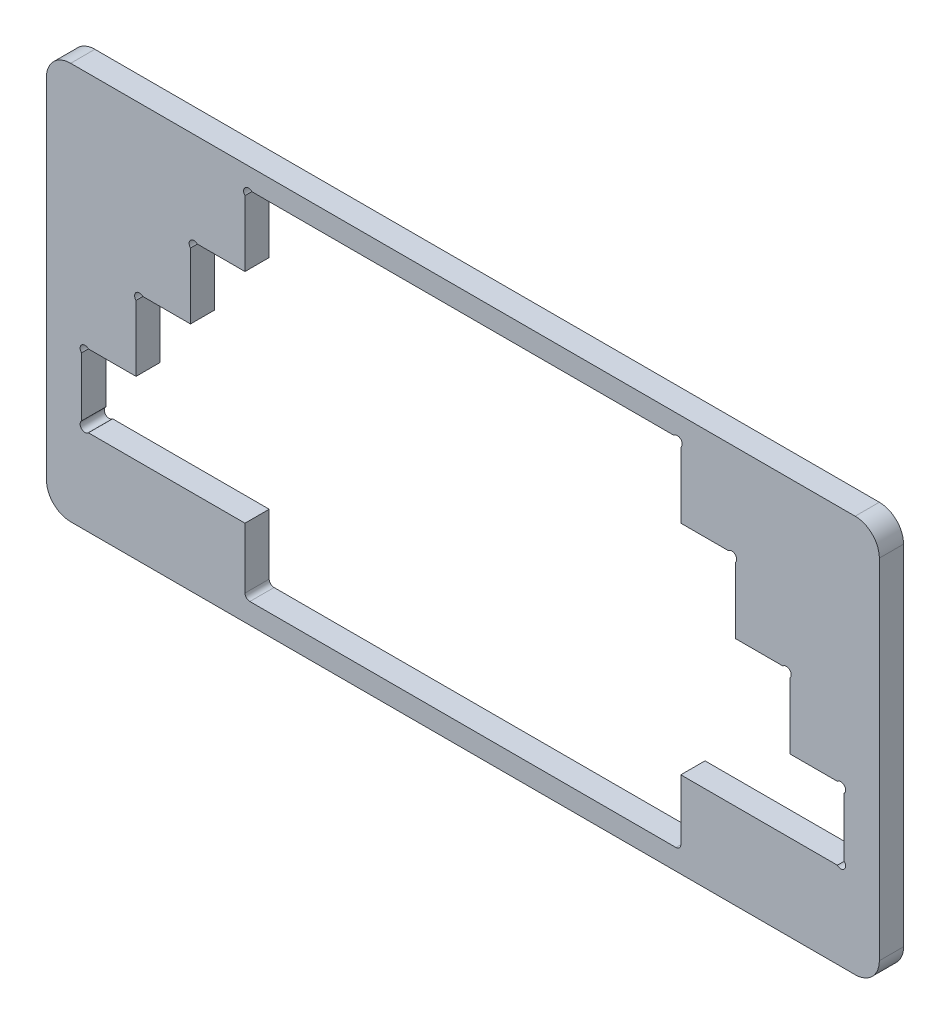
from build123d import *

# Parameters (mm, degrees)
EXTRUSION1_DEPTH = 10


with BuildPart() as part:
    # Esquisse1 → Extrusion1 (new body)
    with BuildSketch(Plane.XY):
        with BuildLine():
            Line((172, 118.5), (172, -25.5))
            ThreePointArc((172, -25.5), (169.071067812, -32.571067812), (162, -35.5))
            Line((162, -35.5), (-162, -35.5))
            ThreePointArc((-162, -35.5), (-169.071067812, -32.571067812), (-172, -25.5))
            Line((-172, -25.5), (-172, 118.5))
            ThreePointArc((-172, 118.5), (-169.071067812, 125.571067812), (-162, 128.5))
            Line((-162, 128.5), (162, 128.5))
            ThreePointArc((162, 128.5), (169.071067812, 125.571067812), (172, 118.5))
        make_face()
        with BuildLine():
            Line((157.5, 27.171572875), (157.5, 2.828427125))
            ThreePointArc((157.5, 2.828427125), (157.5, 0), (154.671572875, 0))
            Line((154.671572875, 0), (90, 0))
            Line((90, 0), (90, -25))
            ThreePointArc((90, -25), (89.414213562, -26.414213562), (88, -27))
            Line((88, -27), (-88, -27))
            ThreePointArc((-88, -27), (-89.414213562, -26.414213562), (-90, -25))
            Line((-90, -25), (-90, 0))
            Line((-90, 0), (-154.671572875, 0))
            ThreePointArc((-154.671572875, 0), (-157.5, 0), (-157.5, 2.828427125))
            Line((-157.5, 2.828427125), (-157.5, 27.171572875))
            ThreePointArc((-157.5, 27.171572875), (-157.5, 30), (-154.671572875, 30))
            Line((-154.671572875, 30), (-135, 30))
            Line((-135, 30), (-135, 57.171572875))
            ThreePointArc((-135, 57.171572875), (-135, 60), (-132.171572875, 60))
            Line((-132.171572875, 60), (-112.5, 60))
            Line((-112.5, 60), (-112.5, 87.171572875))
            ThreePointArc((-112.5, 87.171572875), (-112.5, 90), (-109.671572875, 90))
            Line((-109.671572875, 90), (-90, 90))
            Line((-90, 90), (-90, 117.171572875))
            ThreePointArc((-90, 117.171572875), (-90, 120), (-87.171572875, 120))
            Line((-87.171572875, 120), (87.171572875, 120))
            ThreePointArc((87.171572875, 120), (90, 120), (90, 117.171572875))
            Line((90, 117.171572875), (90, 90))
            Line((90, 90), (109.671572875, 90))
            ThreePointArc((109.671572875, 90), (112.5, 90), (112.5, 87.171572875))
            Line((112.5, 87.171572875), (112.5, 60))
            Line((112.5, 60), (132.171572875, 60))
            ThreePointArc((132.171572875, 60), (135, 60), (135, 57.171572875))
            Line((135, 57.171572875), (135, 30))
            Line((135, 30), (154.671572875, 30))
            ThreePointArc((154.671572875, 30), (157.5, 30), (157.5, 27.171572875))
        make_face(mode=Mode.SUBTRACT)
    extrude(amount=EXTRUSION1_DEPTH)


solid = part.part
